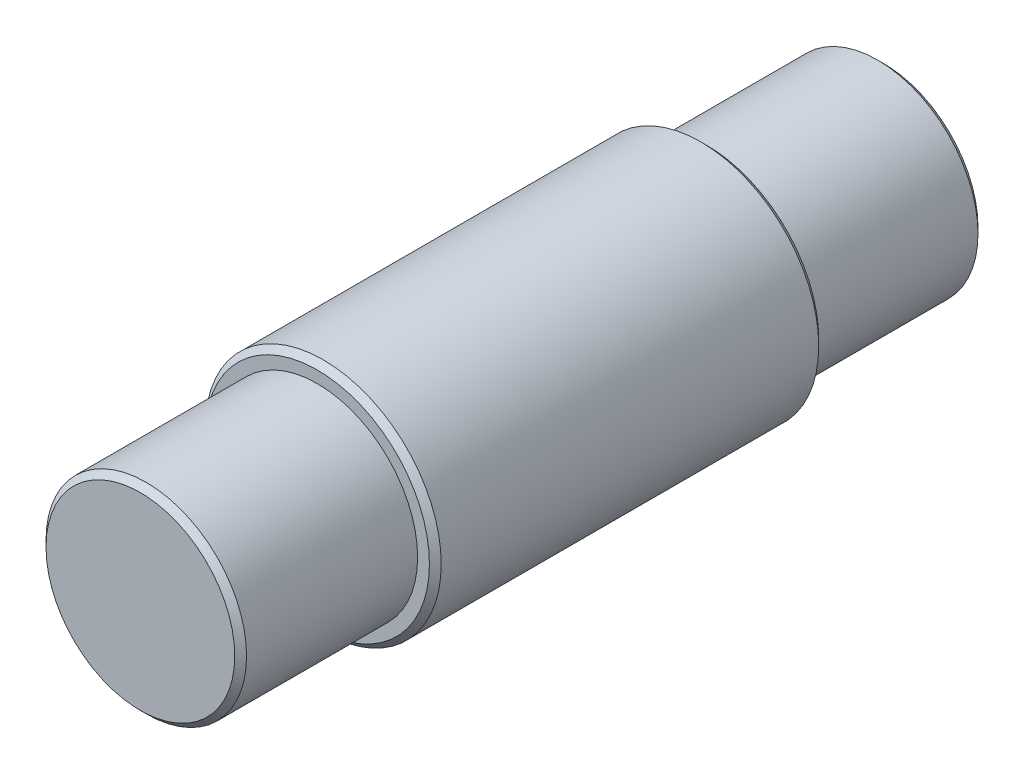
from build123d import *


with BuildPart() as part:
    # Sketch1 → Revolve1 (revolve)
    with BuildSketch(Plane(origin=(0, 0, 0), x_dir=(1, 0, 0), z_dir=(0, 1, 0))):
        Polygon((8, 13), (0, 13), (0, -50), (8, -50), (8.5, -49.5), (8.5, -35), (9.5, -35), (10, -34.5), (10, -2.5), (9.5, -2), (8.5, -2), (8.5, 12.5), align=None)
    revolve(axis=Axis((0, 0, -13), (0, 0, 1)))


solid = part.part
